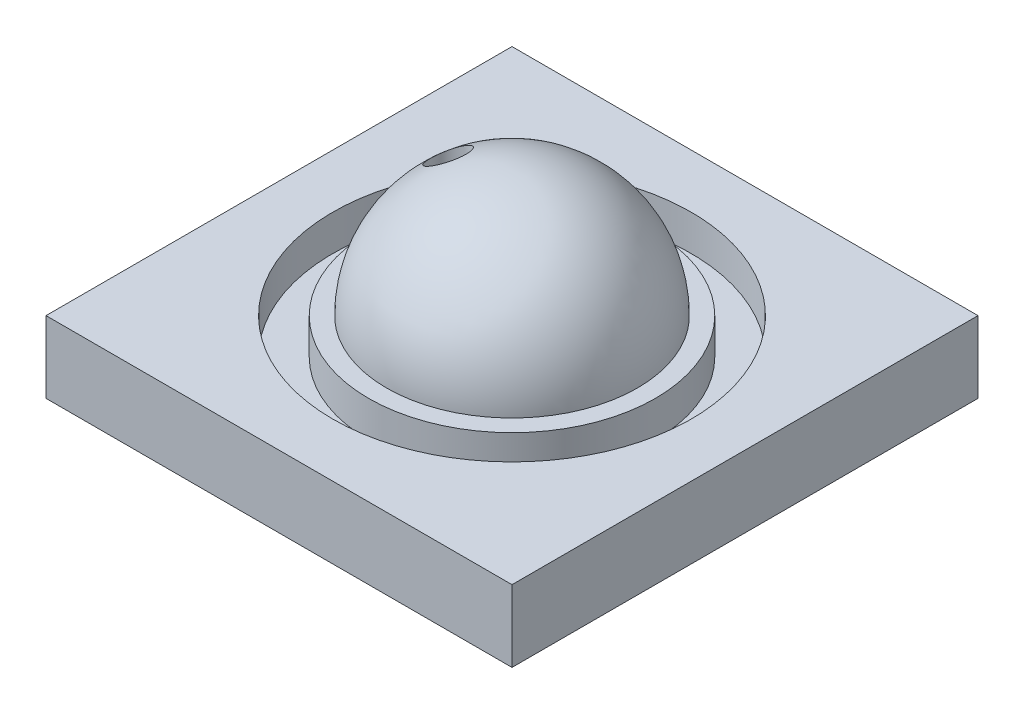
from build123d import *

# Parameters (mm, degrees)
SKETCH2_W           = 26
SKETCH2_H           = 26
BOSS_EXTRUDE1_DEPTH = 4
SKETCH3_R           = 10
SKETCH3_R_2         = 8
CUT_EXTRUDE1_DEPTH  = 2
SKETCH4_R           = 1
CUT_EXTRUDE2_DEPTH  = 12


with BuildPart() as part:
    # Sketch1 → Revolve1 (revolve)
    with BuildSketch(Plane.XY):
        with BuildLine():
            Line((7, 0), (0, 0))
            Line((0, 0), (0, 7))
            ThreePointArc((0, 7), (4.949747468, 4.949747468), (7, 0))
        make_face()
    revolve(axis=Axis((0, 0, 0), (0, 1, 0)))

    # Sketch2 → Boss-Extrude1 (add)
    with BuildSketch(Plane(origin=(0, 0, 0), x_dir=(1, 0, 0), z_dir=(0, 1, 0))):
        Rectangle(SKETCH2_W, SKETCH2_H)
    extrude(amount=-BOSS_EXTRUDE1_DEPTH)

    # Sketch3 → Cut-Extrude1 (cut)
    with BuildSketch(Plane(origin=(0, 0, 0), x_dir=(1, 0, 0), z_dir=(0, 1, 0))):
        with Locations(Location((0, 0, 0), (0, 0, 270))):
            Circle(SKETCH3_R)
        with Locations(Location((0, 0, 0), (0, 0, 270))):
            Circle(SKETCH3_R_2, mode=Mode.SUBTRACT)
    extrude(amount=-CUT_EXTRUDE1_DEPTH, mode=Mode.SUBTRACT)

    # Sketch4 → Cut-Extrude2 (cut)
    with BuildSketch(Plane(origin=(0, 0, 0), x_dir=(1, 0, 0), z_dir=(0, 1, 0))):
        with Locations(Location((-3.567229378, 0, 0), (0, 0, 151.407087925))):
            Circle(SKETCH4_R)
    extrude(amount=CUT_EXTRUDE2_DEPTH, mode=Mode.SUBTRACT)


solid = part.part
